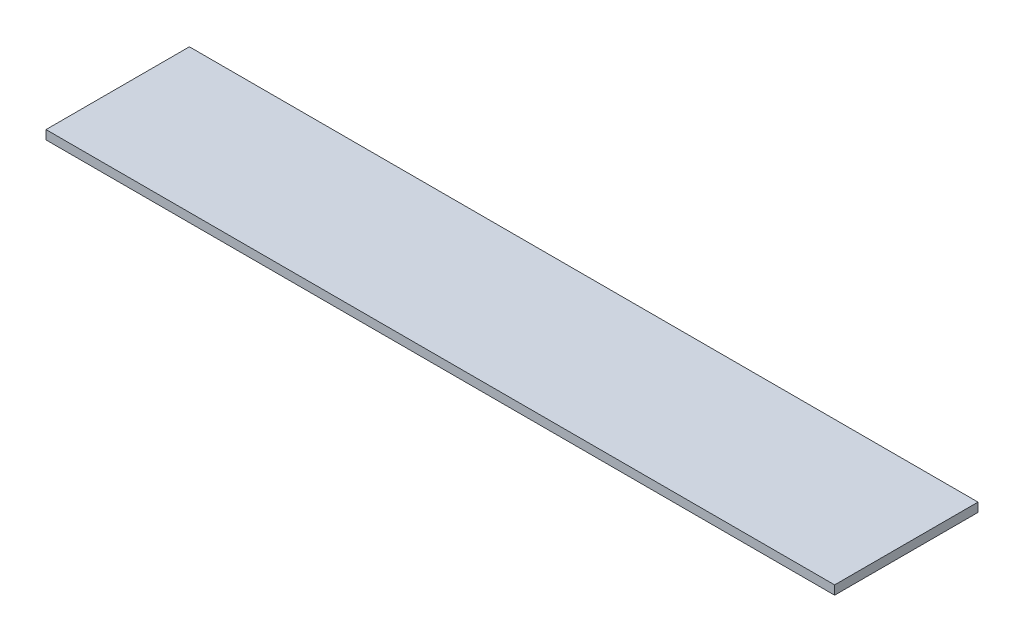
from build123d import *

# Parameters (mm, degrees)
SKETCH1_W           = 558.8
SKETCH1_H           = 101.6
BOSS_EXTRUDE1_DEPTH = 6.35


with BuildPart() as part:
    # Sketch1 → Boss-Extrude1 (new body)
    with BuildSketch(Plane(origin=(0, 0, 0), x_dir=(1, 0, 0), z_dir=(0, 1, 0))):
        Rectangle(SKETCH1_W, SKETCH1_H)
    extrude(amount=BOSS_EXTRUDE1_DEPTH)


solid = part.part
